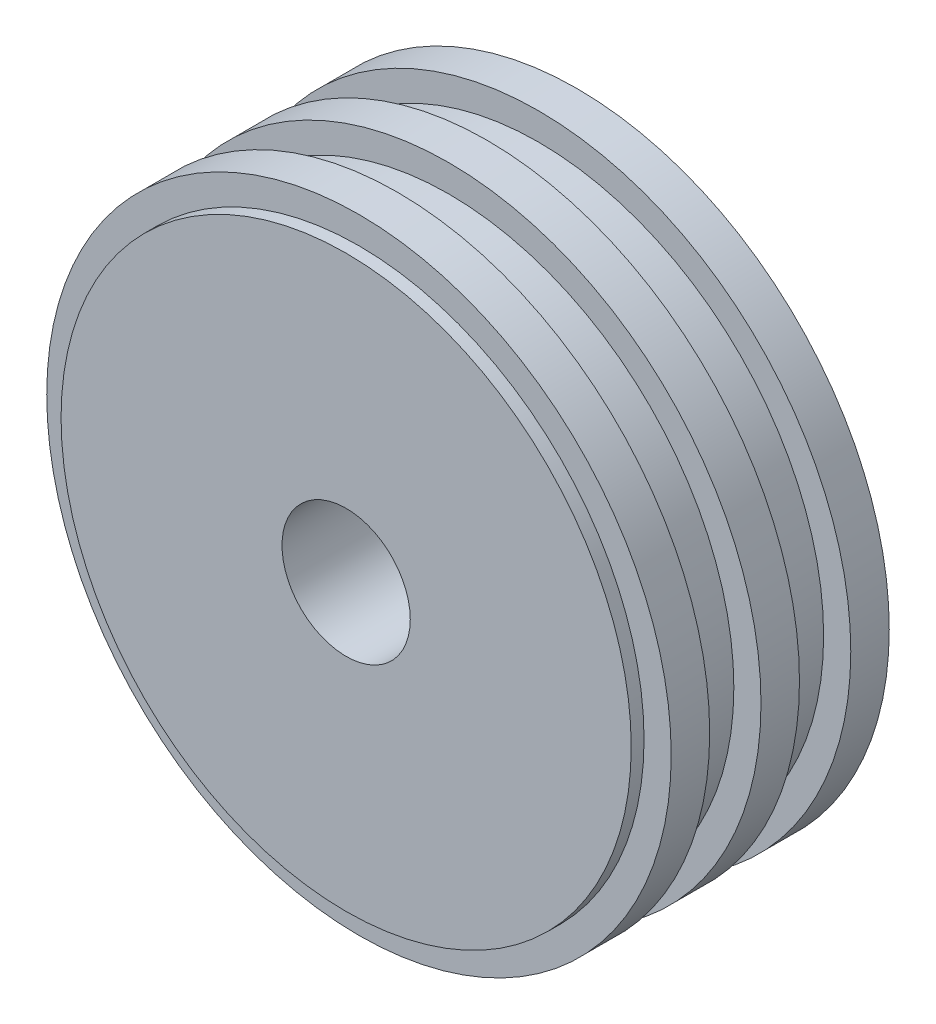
from build123d import *

# Parameters (mm, degrees)
SKETCH1_R           = 66.675
SKETCH1_R_2         = 15
BOSS_EXTRUDE1_DEPTH = 57
SKETCH2_R           = 73.025
SKETCH2_R_2         = 66.675
BOSS_EXTRUDE2_DEPTH = 9
LPATTERN1_COUNT     = 3
LPATTERN1_PITCH     = 21


with BuildPart() as part:
    # Sketch1 → Boss-Extrude1 (new body)
    with BuildSketch(Plane.XY):
        Circle(SKETCH1_R)
        Circle(SKETCH1_R_2, mode=Mode.SUBTRACT)
    extrude(amount=-BOSS_EXTRUDE1_DEPTH)

    # Sketch2 → Boss-Extrude2 (add)
    with BuildSketch(Plane.XY.offset(-3)):
        Circle(SKETCH2_R)
        Circle(SKETCH2_R_2, mode=Mode.SUBTRACT)
    boss_extrude2 = extrude(amount=-BOSS_EXTRUDE2_DEPTH)

    # LPattern1: Boss-Extrude2 ×3
    with Locations(*[(0, 0, -i * LPATTERN1_PITCH) for i in range(1, LPATTERN1_COUNT)]):
        add(boss_extrude2)


solid = part.part
